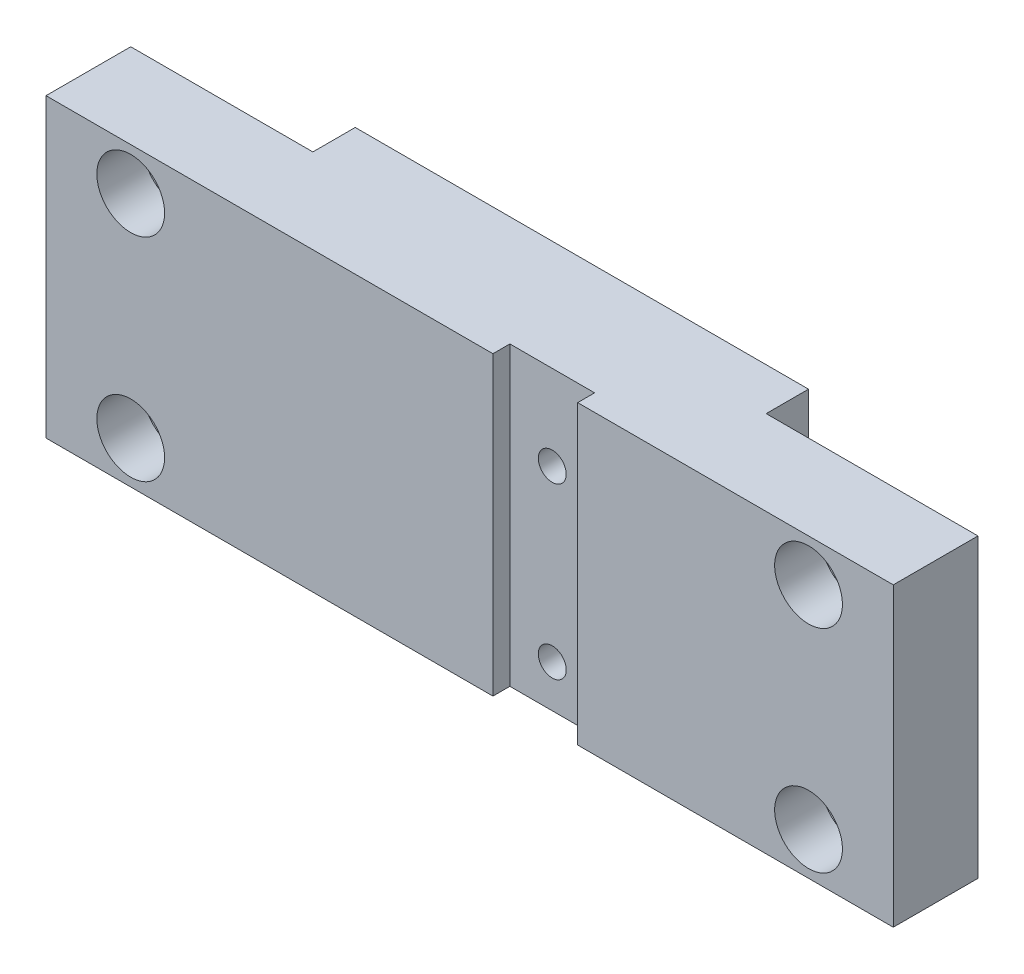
from build123d import *

# Parameters (mm, degrees)
SKETCH_1_W          = 100
SKETCH_1_H          = 35
SKETCH_1_R          = 2.25
SKETCH_1_R_2        = 1.65
EXTRUDE_1_DEPTH     = 15
SKETCH_2_OUTSIDE_W  = 123.4
SKETCH_2_OUTSIDE_H  = 38.4
CUT_EXTRUDE_1_DEPTH = 108.004672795
SKETCH_3_R          = 4
CUT_EXTRUDE_2_DEPTH = 5.5


with BuildPart() as part:
    # Sketch 1 → Extrude 1 (new body)
    with BuildSketch(Plane.XY):
        with Locations((50, 17.5)):
            Rectangle(SKETCH_1_W, SKETCH_1_H)
        with Locations((10, 30)):
            Circle(SKETCH_1_R, mode=Mode.SUBTRACT)
        with Locations((90, 30)):
            Circle(SKETCH_1_R, mode=Mode.SUBTRACT)
        with Locations((90, 5)):
            Circle(SKETCH_1_R, mode=Mode.SUBTRACT)
        with Locations((10, 5)):
            Circle(SKETCH_1_R, mode=Mode.SUBTRACT)
        with Locations((57.75, 25)):
            Circle(SKETCH_1_R_2, mode=Mode.SUBTRACT)
        with Locations((57.75, 5)):
            Circle(SKETCH_1_R_2, mode=Mode.SUBTRACT)
    extrude(amount=EXTRUDE_1_DEPTH)

    # Sketch 2 outside → Cut-Extrude 1 (cut, through all)
    with BuildSketch(Plane(origin=(0, 35, 0), x_dir=(1, 0, 0), z_dir=(0, 1, 0))):
        with Locations((50, -7.5)):
            Rectangle(SKETCH_2_OUTSIDE_W, SKETCH_2_OUTSIDE_H)
        Polygon((0, -5), (21.4975, -5), (21.4975, 0), (74.9975, 0), (74.9975, -5), (100, -5), (100, -15), (62.75, -15), (62.75, -13), (52.75, -13), (52.75, -15), (0, -15), align=None, mode=Mode.SUBTRACT)
    extrude(amount=-CUT_EXTRUDE_1_DEPTH, mode=Mode.SUBTRACT)

    # Sketch 3 → Cut-Extrude 2 (cut)
    with BuildSketch(Plane.XY.offset(15)):
        with Locations((10, 30)):
            Circle(SKETCH_3_R)
        with Locations((90, 30)):
            Circle(SKETCH_3_R)
        with Locations((90, 5)):
            Circle(SKETCH_3_R)
        with Locations((10, 5)):
            Circle(SKETCH_3_R)
    extrude(amount=-CUT_EXTRUDE_2_DEPTH, mode=Mode.SUBTRACT)


solid = part.part
